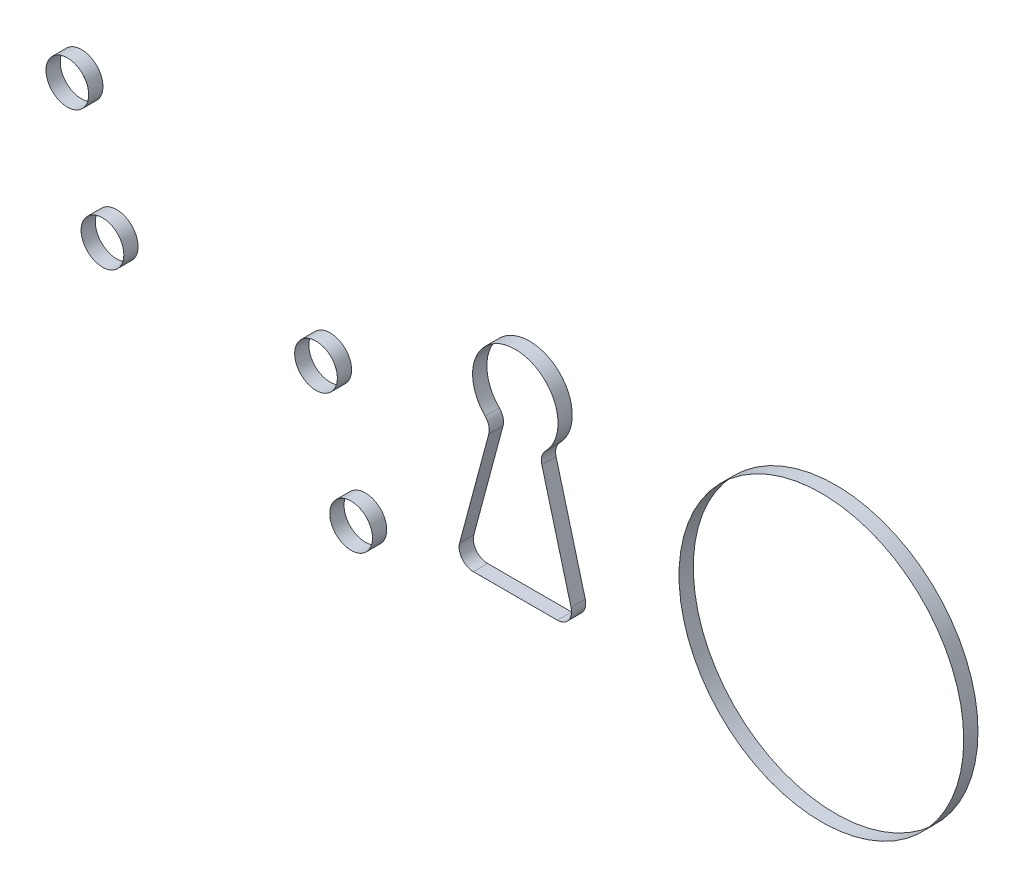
ISO-10303-21;
HEADER;
FILE_DESCRIPTION(('STEP AP214'),'2;1');
FILE_NAME('part.step','',(''),(''),'','','');
FILE_SCHEMA(('AUTOMOTIVE_DESIGN { 1 0 10303 214 1 1 1 1 }'));
ENDSEC;
DATA;
#1=APPLICATION_CONTEXT('core data for automotive mechanical design processes');
#2=APPLICATION_PROTOCOL_DEFINITION('international standard','automotive_design',2000,#1);
#3=PRODUCT_CONTEXT('',#1,'mechanical');
#4=PRODUCT('Part','Part','',(#3));
#5=PRODUCT_RELATED_PRODUCT_CATEGORY('part','',(#4));
#6=PRODUCT_DEFINITION_FORMATION('','',#4);
#7=PRODUCT_DEFINITION_CONTEXT('part definition',#1,'design');
#8=PRODUCT_DEFINITION('design','',#6,#7);
#9=PRODUCT_DEFINITION_SHAPE('','',#8);
#10=(LENGTH_UNIT() NAMED_UNIT(*) SI_UNIT(.MILLI.,.METRE.));
#11=(NAMED_UNIT(*) PLANE_ANGLE_UNIT() SI_UNIT($,.RADIAN.));
#12=(NAMED_UNIT(*) SI_UNIT($,.STERADIAN.) SOLID_ANGLE_UNIT());
#13=UNCERTAINTY_MEASURE_WITH_UNIT(LENGTH_MEASURE(1.E-05),#10,'distance_accuracy_value','');
#14=(GEOMETRIC_REPRESENTATION_CONTEXT(3) GLOBAL_UNCERTAINTY_ASSIGNED_CONTEXT((#13)) GLOBAL_UNIT_ASSIGNED_CONTEXT((#10,
#11,#12)) REPRESENTATION_CONTEXT('',''));
#15=CARTESIAN_POINT('',(0.,0.,0.));
#16=DIRECTION('',(0.,0.,1.));
#17=DIRECTION('',(1.,0.,0.));
#18=AXIS2_PLACEMENT_3D('',#15,#16,#17);
#19=CARTESIAN_POINT('',(43.,0.,1.));
#20=DIRECTION('',(0.,0.,1.));
#21=DIRECTION('',(1.,0.,0.));
#22=AXIS2_PLACEMENT_3D('',#19,#20,#21);
#23=PLANE('',#22);
#24=CARTESIAN_POINT('',(43.,0.,1.));
#25=DIRECTION('',(0.,0.,1.));
#26=DIRECTION('',(1.,0.,0.));
#27=AXIS2_PLACEMENT_3D('',#24,#25,#26);
#28=CIRCLE('',#27,10.001);
#29=CARTESIAN_POINT('',(53.001,0.,1.));
#30=VERTEX_POINT('',#29);
#31=EDGE_CURVE('E12',#30,#30,#28,.T.);
#32=ORIENTED_EDGE('',*,*,#31,.T.);
#33=EDGE_LOOP('',(#32));
#34=FACE_BOUND('',#33,.T.);
#35=CARTESIAN_POINT('',(43.,0.,1.));
#36=DIRECTION('',(0.,0.,1.));
#37=DIRECTION('',(1.,0.,0.));
#38=AXIS2_PLACEMENT_3D('',#35,#36,#37);
#39=CIRCLE('',#38,10.);
#40=CARTESIAN_POINT('',(53.,0.,1.));
#41=VERTEX_POINT('',#40);
#42=EDGE_CURVE('E131',#41,#41,#39,.T.);
#43=ORIENTED_EDGE('',*,*,#42,.F.);
#44=EDGE_LOOP('',(#43));
#45=FACE_BOUND('',#44,.T.);
#46=ADVANCED_FACE('F120',(#34,#45),#23,.T.);
#47=CARTESIAN_POINT('',(43.,0.,0.));
#48=DIRECTION('',(0.,0.,1.));
#49=DIRECTION('',(1.,0.,0.));
#50=AXIS2_PLACEMENT_3D('',#47,#48,#49);
#51=PLANE('',#50);
#52=CARTESIAN_POINT('',(43.,0.,0.));
#53=DIRECTION('',(0.,0.,1.));
#54=DIRECTION('',(1.,0.,0.));
#55=AXIS2_PLACEMENT_3D('',#52,#53,#54);
#56=CIRCLE('',#55,10.001);
#57=CARTESIAN_POINT('',(53.001,0.,0.));
#58=VERTEX_POINT('',#57);
#59=EDGE_CURVE('E124',#58,#58,#56,.T.);
#60=ORIENTED_EDGE('',*,*,#59,.F.);
#61=EDGE_LOOP('',(#60));
#62=FACE_BOUND('',#61,.T.);
#63=CARTESIAN_POINT('',(43.,0.,0.));
#64=DIRECTION('',(0.,0.,1.));
#65=DIRECTION('',(1.,0.,0.));
#66=AXIS2_PLACEMENT_3D('',#63,#64,#65);
#67=CIRCLE('',#66,10.);
#68=CARTESIAN_POINT('',(53.,0.,0.));
#69=VERTEX_POINT('',#68);
#70=EDGE_CURVE('E133',#69,#69,#67,.T.);
#71=ORIENTED_EDGE('',*,*,#70,.T.);
#72=EDGE_LOOP('',(#71));
#73=FACE_BOUND('',#72,.T.);
#74=ADVANCED_FACE('F143',(#62,#73),#51,.F.);
#75=CARTESIAN_POINT('',(43.,0.,1.));
#76=DIRECTION('',(0.,0.,-1.));
#77=DIRECTION('',(-1.,0.,0.));
#78=AXIS2_PLACEMENT_3D('',#75,#76,#77);
#79=CYLINDRICAL_SURFACE('',#78,10.001);
#80=ORIENTED_EDGE('',*,*,#31,.F.);
#81=EDGE_LOOP('',(#80));
#82=FACE_BOUND('',#81,.T.);
#83=ORIENTED_EDGE('',*,*,#59,.T.);
#84=EDGE_LOOP('',(#83));
#85=FACE_BOUND('',#84,.T.);
#86=ADVANCED_FACE('F122',(#82,#85),#79,.T.);
#87=CARTESIAN_POINT('',(43.,0.,1.));
#88=DIRECTION('',(0.,0.,-1.));
#89=DIRECTION('',(-1.,0.,0.));
#90=AXIS2_PLACEMENT_3D('',#87,#88,#89);
#91=CYLINDRICAL_SURFACE('',#90,10.);
#92=ORIENTED_EDGE('',*,*,#42,.T.);
#93=EDGE_LOOP('',(#92));
#94=FACE_BOUND('',#93,.T.);
#95=ORIENTED_EDGE('',*,*,#70,.F.);
#96=EDGE_LOOP('',(#95));
#97=FACE_BOUND('',#96,.T.);
#98=ADVANCED_FACE('F139',(#94,#97),#91,.F.);
#99=CLOSED_SHELL('',(#46,#74,#86,#98));
#100=MANIFOLD_SOLID_BREP('B2',#99);
#101=CARTESIAN_POINT('',(-9.96794863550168,8.49999999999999,1.));
#102=DIRECTION('',(0.,0.,1.));
#103=DIRECTION('',(1.,0.,0.));
#104=AXIS2_PLACEMENT_3D('',#101,#102,#103);
#105=PLANE('',#104);
#106=CARTESIAN_POINT('',(-9.96794863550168,8.49999999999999,1.));
#107=DIRECTION('',(0.,0.,1.));
#108=DIRECTION('',(1.,0.,0.));
#109=AXIS2_PLACEMENT_3D('',#106,#107,#108);
#110=CIRCLE('',#109,1.501);
#111=CARTESIAN_POINT('',(-8.46694863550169,8.49999999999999,1.));
#112=VERTEX_POINT('',#111);
#113=EDGE_CURVE('E119',#112,#112,#110,.T.);
#114=ORIENTED_EDGE('',*,*,#113,.T.);
#115=EDGE_LOOP('',(#114));
#116=FACE_BOUND('',#115,.T.);
#117=CARTESIAN_POINT('',(-9.96794863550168,8.49999999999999,1.));
#118=DIRECTION('',(0.,0.,1.));
#119=DIRECTION('',(1.,0.,0.));
#120=AXIS2_PLACEMENT_3D('',#117,#118,#119);
#121=CIRCLE('',#120,1.5);
#122=CARTESIAN_POINT('',(-8.46794863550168,8.49999999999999,1.));
#123=VERTEX_POINT('',#122);
#124=EDGE_CURVE('E201',#123,#123,#121,.T.);
#125=ORIENTED_EDGE('',*,*,#124,.F.);
#126=EDGE_LOOP('',(#125));
#127=FACE_BOUND('',#126,.T.);
#128=ADVANCED_FACE('F190',(#116,#127),#105,.T.);
#129=CARTESIAN_POINT('',(-9.96794863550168,8.49999999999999,0.));
#130=DIRECTION('',(0.,0.,1.));
#131=DIRECTION('',(1.,0.,0.));
#132=AXIS2_PLACEMENT_3D('',#129,#130,#131);
#133=PLANE('',#132);
#134=CARTESIAN_POINT('',(-9.96794863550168,8.49999999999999,0.));
#135=DIRECTION('',(0.,0.,1.));
#136=DIRECTION('',(1.,0.,0.));
#137=AXIS2_PLACEMENT_3D('',#134,#135,#136);
#138=CIRCLE('',#137,1.501);
#139=CARTESIAN_POINT('',(-8.46694863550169,8.49999999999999,0.));
#140=VERTEX_POINT('',#139);
#141=EDGE_CURVE('E194',#140,#140,#138,.T.);
#142=ORIENTED_EDGE('',*,*,#141,.F.);
#143=EDGE_LOOP('',(#142));
#144=FACE_BOUND('',#143,.T.);
#145=CARTESIAN_POINT('',(-9.96794863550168,8.49999999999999,0.));
#146=DIRECTION('',(0.,0.,1.));
#147=DIRECTION('',(1.,0.,0.));
#148=AXIS2_PLACEMENT_3D('',#145,#146,#147);
#149=CIRCLE('',#148,1.5);
#150=CARTESIAN_POINT('',(-8.46794863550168,8.49999999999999,0.));
#151=VERTEX_POINT('',#150);
#152=EDGE_CURVE('E203',#151,#151,#149,.T.);
#153=ORIENTED_EDGE('',*,*,#152,.T.);
#154=EDGE_LOOP('',(#153));
#155=FACE_BOUND('',#154,.T.);
#156=ADVANCED_FACE('F213',(#144,#155),#133,.F.);
#157=CARTESIAN_POINT('',(-9.96794863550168,8.49999999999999,1.));
#158=DIRECTION('',(0.,0.,-1.));
#159=DIRECTION('',(-1.,0.,0.));
#160=AXIS2_PLACEMENT_3D('',#157,#158,#159);
#161=CYLINDRICAL_SURFACE('',#160,1.501);
#162=ORIENTED_EDGE('',*,*,#113,.F.);
#163=EDGE_LOOP('',(#162));
#164=FACE_BOUND('',#163,.T.);
#165=ORIENTED_EDGE('',*,*,#141,.T.);
#166=EDGE_LOOP('',(#165));
#167=FACE_BOUND('',#166,.T.);
#168=ADVANCED_FACE('F192',(#164,#167),#161,.T.);
#169=CARTESIAN_POINT('',(-9.96794863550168,8.49999999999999,1.));
#170=DIRECTION('',(0.,0.,-1.));
#171=DIRECTION('',(-1.,0.,0.));
#172=AXIS2_PLACEMENT_3D('',#169,#170,#171);
#173=CYLINDRICAL_SURFACE('',#172,1.5);
#174=ORIENTED_EDGE('',*,*,#124,.T.);
#175=EDGE_LOOP('',(#174));
#176=FACE_BOUND('',#175,.T.);
#177=ORIENTED_EDGE('',*,*,#152,.F.);
#178=EDGE_LOOP('',(#177));
#179=FACE_BOUND('',#178,.T.);
#180=ADVANCED_FACE('F209',(#176,#179),#173,.F.);
#181=CLOSED_SHELL('',(#128,#156,#168,#180));
#182=MANIFOLD_SOLID_BREP('B7',#181);
#183=CARTESIAN_POINT('',(9.96794863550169,-8.5,1.));
#184=DIRECTION('',(0.,0.,1.));
#185=DIRECTION('',(1.,0.,0.));
#186=AXIS2_PLACEMENT_3D('',#183,#184,#185);
#187=PLANE('',#186);
#188=CARTESIAN_POINT('',(9.96794863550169,-8.5,1.));
#189=DIRECTION('',(0.,0.,1.));
#190=DIRECTION('',(1.,0.,0.));
#191=AXIS2_PLACEMENT_3D('',#188,#189,#190);
#192=CIRCLE('',#191,1.501);
#193=CARTESIAN_POINT('',(11.4689486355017,-8.5,1.));
#194=VERTEX_POINT('',#193);
#195=EDGE_CURVE('E189',#194,#194,#192,.T.);
#196=ORIENTED_EDGE('',*,*,#195,.T.);
#197=EDGE_LOOP('',(#196));
#198=FACE_BOUND('',#197,.T.);
#199=CARTESIAN_POINT('',(9.96794863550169,-8.5,1.));
#200=DIRECTION('',(0.,0.,1.));
#201=DIRECTION('',(1.,0.,0.));
#202=AXIS2_PLACEMENT_3D('',#199,#200,#201);
#203=CIRCLE('',#202,1.5);
#204=CARTESIAN_POINT('',(11.4679486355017,-8.5,1.));
#205=VERTEX_POINT('',#204);
#206=EDGE_CURVE('E271',#205,#205,#203,.T.);
#207=ORIENTED_EDGE('',*,*,#206,.F.);
#208=EDGE_LOOP('',(#207));
#209=FACE_BOUND('',#208,.T.);
#210=ADVANCED_FACE('F260',(#198,#209),#187,.T.);
#211=CARTESIAN_POINT('',(9.96794863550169,-8.5,0.));
#212=DIRECTION('',(0.,0.,1.));
#213=DIRECTION('',(1.,0.,0.));
#214=AXIS2_PLACEMENT_3D('',#211,#212,#213);
#215=PLANE('',#214);
#216=CARTESIAN_POINT('',(9.96794863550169,-8.5,0.));
#217=DIRECTION('',(0.,0.,1.));
#218=DIRECTION('',(1.,0.,0.));
#219=AXIS2_PLACEMENT_3D('',#216,#217,#218);
#220=CIRCLE('',#219,1.501);
#221=CARTESIAN_POINT('',(11.4689486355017,-8.5,0.));
#222=VERTEX_POINT('',#221);
#223=EDGE_CURVE('E264',#222,#222,#220,.T.);
#224=ORIENTED_EDGE('',*,*,#223,.F.);
#225=EDGE_LOOP('',(#224));
#226=FACE_BOUND('',#225,.T.);
#227=CARTESIAN_POINT('',(9.96794863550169,-8.5,0.));
#228=DIRECTION('',(0.,0.,1.));
#229=DIRECTION('',(1.,0.,0.));
#230=AXIS2_PLACEMENT_3D('',#227,#228,#229);
#231=CIRCLE('',#230,1.5);
#232=CARTESIAN_POINT('',(11.4679486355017,-8.5,0.));
#233=VERTEX_POINT('',#232);
#234=EDGE_CURVE('E273',#233,#233,#231,.T.);
#235=ORIENTED_EDGE('',*,*,#234,.T.);
#236=EDGE_LOOP('',(#235));
#237=FACE_BOUND('',#236,.T.);
#238=ADVANCED_FACE('F283',(#226,#237),#215,.F.);
#239=CARTESIAN_POINT('',(9.96794863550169,-8.5,1.));
#240=DIRECTION('',(0.,0.,-1.));
#241=DIRECTION('',(-1.,0.,0.));
#242=AXIS2_PLACEMENT_3D('',#239,#240,#241);
#243=CYLINDRICAL_SURFACE('',#242,1.501);
#244=ORIENTED_EDGE('',*,*,#195,.F.);
#245=EDGE_LOOP('',(#244));
#246=FACE_BOUND('',#245,.T.);
#247=ORIENTED_EDGE('',*,*,#223,.T.);
#248=EDGE_LOOP('',(#247));
#249=FACE_BOUND('',#248,.T.);
#250=ADVANCED_FACE('F262',(#246,#249),#243,.T.);
#251=CARTESIAN_POINT('',(9.96794863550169,-8.5,1.));
#252=DIRECTION('',(0.,0.,-1.));
#253=DIRECTION('',(-1.,0.,0.));
#254=AXIS2_PLACEMENT_3D('',#251,#252,#253);
#255=CYLINDRICAL_SURFACE('',#254,1.5);
#256=ORIENTED_EDGE('',*,*,#206,.T.);
#257=EDGE_LOOP('',(#256));
#258=FACE_BOUND('',#257,.T.);
#259=ORIENTED_EDGE('',*,*,#234,.F.);
#260=EDGE_LOOP('',(#259));
#261=FACE_BOUND('',#260,.T.);
#262=ADVANCED_FACE('F279',(#258,#261),#255,.F.);
#263=CLOSED_SHELL('',(#210,#238,#250,#262));
#264=MANIFOLD_SOLID_BREP('B114',#263);
#265=CARTESIAN_POINT('',(-7.5,0.,1.));
#266=DIRECTION('',(0.,0.,1.));
#267=DIRECTION('',(1.,0.,0.));
#268=AXIS2_PLACEMENT_3D('',#265,#266,#267);
#269=PLANE('',#268);
#270=CARTESIAN_POINT('',(-7.5,0.,1.));
#271=DIRECTION('',(0.,0.,1.));
#272=DIRECTION('',(1.,0.,0.));
#273=AXIS2_PLACEMENT_3D('',#270,#271,#272);
#274=CIRCLE('',#273,1.501);
#275=CARTESIAN_POINT('',(-5.999,0.,1.));
#276=VERTEX_POINT('',#275);
#277=EDGE_CURVE('E259',#276,#276,#274,.T.);
#278=ORIENTED_EDGE('',*,*,#277,.T.);
#279=EDGE_LOOP('',(#278));
#280=FACE_BOUND('',#279,.T.);
#281=CARTESIAN_POINT('',(-7.5,0.,1.));
#282=DIRECTION('',(0.,0.,1.));
#283=DIRECTION('',(1.,0.,0.));
#284=AXIS2_PLACEMENT_3D('',#281,#282,#283);
#285=CIRCLE('',#284,1.5);
#286=CARTESIAN_POINT('',(-6.,0.,1.));
#287=VERTEX_POINT('',#286);
#288=EDGE_CURVE('E341',#287,#287,#285,.T.);
#289=ORIENTED_EDGE('',*,*,#288,.F.);
#290=EDGE_LOOP('',(#289));
#291=FACE_BOUND('',#290,.T.);
#292=ADVANCED_FACE('F330',(#280,#291),#269,.T.);
#293=CARTESIAN_POINT('',(-7.5,0.,0.));
#294=DIRECTION('',(0.,0.,1.));
#295=DIRECTION('',(1.,0.,0.));
#296=AXIS2_PLACEMENT_3D('',#293,#294,#295);
#297=PLANE('',#296);
#298=CARTESIAN_POINT('',(-7.5,0.,0.));
#299=DIRECTION('',(0.,0.,1.));
#300=DIRECTION('',(1.,0.,0.));
#301=AXIS2_PLACEMENT_3D('',#298,#299,#300);
#302=CIRCLE('',#301,1.501);
#303=CARTESIAN_POINT('',(-5.999,0.,0.));
#304=VERTEX_POINT('',#303);
#305=EDGE_CURVE('E334',#304,#304,#302,.T.);
#306=ORIENTED_EDGE('',*,*,#305,.F.);
#307=EDGE_LOOP('',(#306));
#308=FACE_BOUND('',#307,.T.);
#309=CARTESIAN_POINT('',(-7.5,0.,0.));
#310=DIRECTION('',(0.,0.,1.));
#311=DIRECTION('',(1.,0.,0.));
#312=AXIS2_PLACEMENT_3D('',#309,#310,#311);
#313=CIRCLE('',#312,1.5);
#314=CARTESIAN_POINT('',(-6.,0.,0.));
#315=VERTEX_POINT('',#314);
#316=EDGE_CURVE('E343',#315,#315,#313,.T.);
#317=ORIENTED_EDGE('',*,*,#316,.T.);
#318=EDGE_LOOP('',(#317));
#319=FACE_BOUND('',#318,.T.);
#320=ADVANCED_FACE('F353',(#308,#319),#297,.F.);
#321=CARTESIAN_POINT('',(-7.5,0.,1.));
#322=DIRECTION('',(0.,0.,-1.));
#323=DIRECTION('',(-1.,0.,0.));
#324=AXIS2_PLACEMENT_3D('',#321,#322,#323);
#325=CYLINDRICAL_SURFACE('',#324,1.501);
#326=ORIENTED_EDGE('',*,*,#277,.F.);
#327=EDGE_LOOP('',(#326));
#328=FACE_BOUND('',#327,.T.);
#329=ORIENTED_EDGE('',*,*,#305,.T.);
#330=EDGE_LOOP('',(#329));
#331=FACE_BOUND('',#330,.T.);
#332=ADVANCED_FACE('F332',(#328,#331),#325,.T.);
#333=CARTESIAN_POINT('',(-7.5,0.,1.));
#334=DIRECTION('',(0.,0.,-1.));
#335=DIRECTION('',(-1.,0.,0.));
#336=AXIS2_PLACEMENT_3D('',#333,#334,#335);
#337=CYLINDRICAL_SURFACE('',#336,1.5);
#338=ORIENTED_EDGE('',*,*,#288,.T.);
#339=EDGE_LOOP('',(#338));
#340=FACE_BOUND('',#339,.T.);
#341=ORIENTED_EDGE('',*,*,#316,.F.);
#342=EDGE_LOOP('',(#341));
#343=FACE_BOUND('',#342,.T.);
#344=ADVANCED_FACE('F349',(#340,#343),#337,.F.);
#345=CLOSED_SHELL('',(#292,#320,#332,#344));
#346=MANIFOLD_SOLID_BREP('B184',#345);
#347=CARTESIAN_POINT('',(7.5,0.,1.));
#348=DIRECTION('',(0.,0.,1.));
#349=DIRECTION('',(1.,0.,0.));
#350=AXIS2_PLACEMENT_3D('',#347,#348,#349);
#351=PLANE('',#350);
#352=CARTESIAN_POINT('',(7.5,0.,1.));
#353=DIRECTION('',(0.,0.,1.));
#354=DIRECTION('',(1.,0.,0.));
#355=AXIS2_PLACEMENT_3D('',#352,#353,#354);
#356=CIRCLE('',#355,1.501);
#357=CARTESIAN_POINT('',(9.001,0.,1.));
#358=VERTEX_POINT('',#357);
#359=EDGE_CURVE('E329',#358,#358,#356,.T.);
#360=ORIENTED_EDGE('',*,*,#359,.T.);
#361=EDGE_LOOP('',(#360));
#362=FACE_BOUND('',#361,.T.);
#363=CARTESIAN_POINT('',(7.5,0.,1.));
#364=DIRECTION('',(0.,0.,1.));
#365=DIRECTION('',(1.,0.,0.));
#366=AXIS2_PLACEMENT_3D('',#363,#364,#365);
#367=CIRCLE('',#366,1.5);
#368=CARTESIAN_POINT('',(9.00000000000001,0.,1.));
#369=VERTEX_POINT('',#368);
#370=EDGE_CURVE('E412',#369,#369,#367,.T.);
#371=ORIENTED_EDGE('',*,*,#370,.F.);
#372=EDGE_LOOP('',(#371));
#373=FACE_BOUND('',#372,.T.);
#374=ADVANCED_FACE('F401',(#362,#373),#351,.T.);
#375=CARTESIAN_POINT('',(7.5,0.,0.));
#376=DIRECTION('',(0.,0.,1.));
#377=DIRECTION('',(1.,0.,0.));
#378=AXIS2_PLACEMENT_3D('',#375,#376,#377);
#379=PLANE('',#378);
#380=CARTESIAN_POINT('',(7.5,0.,0.));
#381=DIRECTION('',(0.,0.,1.));
#382=DIRECTION('',(1.,0.,0.));
#383=AXIS2_PLACEMENT_3D('',#380,#381,#382);
#384=CIRCLE('',#383,1.501);
#385=CARTESIAN_POINT('',(9.001,0.,0.));
#386=VERTEX_POINT('',#385);
#387=EDGE_CURVE('E405',#386,#386,#384,.T.);
#388=ORIENTED_EDGE('',*,*,#387,.F.);
#389=EDGE_LOOP('',(#388));
#390=FACE_BOUND('',#389,.T.);
#391=CARTESIAN_POINT('',(7.5,0.,0.));
#392=DIRECTION('',(0.,0.,1.));
#393=DIRECTION('',(1.,0.,0.));
#394=AXIS2_PLACEMENT_3D('',#391,#392,#393);
#395=CIRCLE('',#394,1.5);
#396=CARTESIAN_POINT('',(9.00000000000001,0.,0.));
#397=VERTEX_POINT('',#396);
#398=EDGE_CURVE('E414',#397,#397,#395,.T.);
#399=ORIENTED_EDGE('',*,*,#398,.T.);
#400=EDGE_LOOP('',(#399));
#401=FACE_BOUND('',#400,.T.);
#402=ADVANCED_FACE('F424',(#390,#401),#379,.F.);
#403=CARTESIAN_POINT('',(7.5,0.,1.));
#404=DIRECTION('',(0.,0.,-1.));
#405=DIRECTION('',(-1.,0.,0.));
#406=AXIS2_PLACEMENT_3D('',#403,#404,#405);
#407=CYLINDRICAL_SURFACE('',#406,1.501);
#408=ORIENTED_EDGE('',*,*,#359,.F.);
#409=EDGE_LOOP('',(#408));
#410=FACE_BOUND('',#409,.T.);
#411=ORIENTED_EDGE('',*,*,#387,.T.);
#412=EDGE_LOOP('',(#411));
#413=FACE_BOUND('',#412,.T.);
#414=ADVANCED_FACE('F403',(#410,#413),#407,.T.);
#415=CARTESIAN_POINT('',(7.5,0.,1.));
#416=DIRECTION('',(0.,0.,-1.));
#417=DIRECTION('',(-1.,0.,0.));
#418=AXIS2_PLACEMENT_3D('',#415,#416,#417);
#419=CYLINDRICAL_SURFACE('',#418,1.5);
#420=ORIENTED_EDGE('',*,*,#370,.T.);
#421=EDGE_LOOP('',(#420));
#422=FACE_BOUND('',#421,.T.);
#423=ORIENTED_EDGE('',*,*,#398,.F.);
#424=EDGE_LOOP('',(#423));
#425=FACE_BOUND('',#424,.T.);
#426=ADVANCED_FACE('F420',(#422,#425),#419,.F.);
#427=CLOSED_SHELL('',(#374,#402,#414,#426));
#428=MANIFOLD_SOLID_BREP('B254',#427);
#429=CARTESIAN_POINT('',(24.4474411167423,-6.,1.));
#430=DIRECTION('',(0.,0.,1.));
#431=DIRECTION('',(1.,0.,0.));
#432=AXIS2_PLACEMENT_3D('',#429,#430,#431);
#433=PLANE('',#432);
#434=CARTESIAN_POINT('',(24.4474411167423,-6.,1.));
#435=DIRECTION('',(0.,0.,1.));
#436=DIRECTION('',(1.,0.,0.));
#437=AXIS2_PLACEMENT_3D('',#434,#435,#436);
#438=CIRCLE('',#437,1.001);
#439=CARTESIAN_POINT('',(24.4474411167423,-7.001,1.));
#440=VERTEX_POINT('',#439);
#441=CARTESIAN_POINT('',(25.4143328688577,-5.74092213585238,1.));
#442=VERTEX_POINT('',#441);
#443=EDGE_CURVE('E641',#440,#442,#438,.T.);
#444=ORIENTED_EDGE('',*,*,#443,.T.);
#445=DIRECTION('',(-0.258819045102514,0.96592582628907,0.));
#446=VECTOR('',#445,1.);
#447=CARTESIAN_POINT('',(25.4143328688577,-5.74092213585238,1.));
#448=LINE('',#447,#446);
#449=CARTESIAN_POINT('',(23.3634672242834,1.9130126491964,1.));
#450=VERTEX_POINT('',#449);
#451=EDGE_CURVE('E644',#442,#450,#448,.T.);
#452=ORIENTED_EDGE('',*,*,#451,.T.);
#453=CARTESIAN_POINT('',(24.3284271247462,2.17157287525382,1.));
#454=DIRECTION('',(0.,0.,1.));
#455=DIRECTION('',(1.,0.,0.));
#456=AXIS2_PLACEMENT_3D('',#453,#454,#455);
#457=CIRCLE('',#456,0.999000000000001);
#458=CARTESIAN_POINT('',(23.6220274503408,2.87797254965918,1.));
#459=VERTEX_POINT('',#458);
#460=EDGE_CURVE('E647',#450,#459,#457,.F.);
#461=ORIENTED_EDGE('',*,*,#460,.T.);
#462=CARTESIAN_POINT('',(21.5,5.,1.));
#463=DIRECTION('',(0.,0.,1.));
#464=DIRECTION('',(1.,0.,0.));
#465=AXIS2_PLACEMENT_3D('',#462,#463,#464);
#466=CIRCLE('',#465,3.001);
#467=CARTESIAN_POINT('',(19.3779725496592,2.87797254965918,1.));
#468=VERTEX_POINT('',#467);
#469=EDGE_CURVE('E649',#459,#468,#466,.T.);
#470=ORIENTED_EDGE('',*,*,#469,.T.);
#471=CARTESIAN_POINT('',(18.6715728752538,2.17157287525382,1.));
#472=DIRECTION('',(0.,0.,1.));
#473=DIRECTION('',(1.,0.,0.));
#474=AXIS2_PLACEMENT_3D('',#471,#472,#473);
#475=CIRCLE('',#474,0.999);
#476=CARTESIAN_POINT('',(19.6365327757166,1.91301264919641,1.));
#477=VERTEX_POINT('',#476);
#478=EDGE_CURVE('E651',#468,#477,#475,.F.);
#479=ORIENTED_EDGE('',*,*,#478,.T.);
#480=DIRECTION('',(-0.258819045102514,-0.96592582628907,0.));
#481=VECTOR('',#480,1.);
#482=CARTESIAN_POINT('',(19.6365327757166,1.91301264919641,1.));
#483=LINE('',#482,#481);
#484=CARTESIAN_POINT('',(17.5856671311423,-5.74092213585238,1.));
#485=VERTEX_POINT('',#484);
#486=EDGE_CURVE('E653',#477,#485,#483,.T.);
#487=ORIENTED_EDGE('',*,*,#486,.T.);
#488=CARTESIAN_POINT('',(18.5525588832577,-6.,1.));
#489=DIRECTION('',(0.,0.,1.));
#490=DIRECTION('',(1.,0.,0.));
#491=AXIS2_PLACEMENT_3D('',#488,#489,#490);
#492=CIRCLE('',#491,1.001);
#493=CARTESIAN_POINT('',(18.5525588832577,-7.001,1.));
#494=VERTEX_POINT('',#493);
#495=EDGE_CURVE('E655',#485,#494,#492,.T.);
#496=ORIENTED_EDGE('',*,*,#495,.T.);
#497=DIRECTION('',(1.,0.,0.));
#498=VECTOR('',#497,1.);
#499=CARTESIAN_POINT('',(18.5525588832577,-7.001,1.));
#500=LINE('',#499,#498);
#501=EDGE_CURVE('E657',#494,#440,#500,.T.);
#502=ORIENTED_EDGE('',*,*,#501,.T.);
#503=EDGE_LOOP('',(#444,#452,#461,#470,#479,#487,#496,#502));
#504=FACE_BOUND('',#503,.T.);
#505=DIRECTION('',(-0.258819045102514,0.96592582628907,0.));
#506=VECTOR('',#505,1.);
#507=CARTESIAN_POINT('',(25.4133669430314,-5.74118095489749,1.));
#508=LINE('',#507,#506);
#509=CARTESIAN_POINT('',(25.4133669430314,-5.74118095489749,1.));
#510=VERTEX_POINT('',#509);
#511=CARTESIAN_POINT('',(23.3625012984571,1.9127538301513,1.));
#512=VERTEX_POINT('',#511);
#513=EDGE_CURVE('E584',#510,#512,#508,.T.);
#514=ORIENTED_EDGE('',*,*,#513,.F.);
#515=CARTESIAN_POINT('',(24.4474411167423,-6.,1.));
#516=DIRECTION('',(0.,0.,1.));
#517=DIRECTION('',(1.,0.,0.));
#518=AXIS2_PLACEMENT_3D('',#515,#516,#517);
#519=CIRCLE('',#518,1.);
#520=CARTESIAN_POINT('',(24.4474411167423,-7.,1.));
#521=VERTEX_POINT('',#520);
#522=EDGE_CURVE('E576',#521,#510,#519,.T.);
#523=ORIENTED_EDGE('',*,*,#522,.F.);
#524=DIRECTION('',(1.,0.,0.));
#525=VECTOR('',#524,1.);
#526=CARTESIAN_POINT('',(18.5525588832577,-7.,1.));
#527=LINE('',#526,#525);
#528=CARTESIAN_POINT('',(18.5525588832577,-7.,1.));
#529=VERTEX_POINT('',#528);
#530=EDGE_CURVE('E609',#529,#521,#527,.T.);
#531=ORIENTED_EDGE('',*,*,#530,.F.);
#532=CARTESIAN_POINT('',(18.5525588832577,-6.,1.));
#533=DIRECTION('',(0.,0.,1.));
#534=DIRECTION('',(1.,0.,0.));
#535=AXIS2_PLACEMENT_3D('',#532,#533,#534);
#536=CIRCLE('',#535,1.);
#537=CARTESIAN_POINT('',(17.5866330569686,-5.74118095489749,1.));
#538=VERTEX_POINT('',#537);
#539=EDGE_CURVE('E607',#538,#529,#536,.T.);
#540=ORIENTED_EDGE('',*,*,#539,.F.);
#541=DIRECTION('',(-0.258819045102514,-0.96592582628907,0.));
#542=VECTOR('',#541,1.);
#543=CARTESIAN_POINT('',(19.6374987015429,1.9127538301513,1.));
#544=LINE('',#543,#542);
#545=CARTESIAN_POINT('',(19.6374987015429,1.9127538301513,1.));
#546=VERTEX_POINT('',#545);
#547=EDGE_CURVE('E605',#546,#538,#544,.T.);
#548=ORIENTED_EDGE('',*,*,#547,.F.);
#549=CARTESIAN_POINT('',(18.6715728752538,2.17157287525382,1.));
#550=DIRECTION('',(0.,0.,-1.));
#551=DIRECTION('',(1.,0.,0.));
#552=AXIS2_PLACEMENT_3D('',#549,#550,#551);
#553=CIRCLE('',#552,1.);
#554=CARTESIAN_POINT('',(19.3786796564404,2.87867965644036,1.));
#555=VERTEX_POINT('',#554);
#556=EDGE_CURVE('E603',#555,#546,#553,.T.);
#557=ORIENTED_EDGE('',*,*,#556,.F.);
#558=CARTESIAN_POINT('',(21.5,5.,1.));
#559=DIRECTION('',(0.,0.,1.));
#560=DIRECTION('',(1.,0.,0.));
#561=AXIS2_PLACEMENT_3D('',#558,#559,#560);
#562=CIRCLE('',#561,3.);
#563=CARTESIAN_POINT('',(23.6213203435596,2.87867965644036,1.));
#564=VERTEX_POINT('',#563);
#565=EDGE_CURVE('E599',#564,#555,#562,.T.);
#566=ORIENTED_EDGE('',*,*,#565,.F.);
#567=CARTESIAN_POINT('',(24.3284271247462,2.17157287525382,1.));
#568=DIRECTION('',(0.,0.,-1.));
#569=DIRECTION('',(1.,0.,0.));
#570=AXIS2_PLACEMENT_3D('',#567,#568,#569);
#571=CIRCLE('',#570,1.);
#572=EDGE_CURVE('E597',#512,#564,#571,.T.);
#573=ORIENTED_EDGE('',*,*,#572,.F.);
#574=EDGE_LOOP('',(#514,#523,#531,#540,#548,#557,#566,#573));
#575=FACE_BOUND('',#574,.T.);
#576=ADVANCED_FACE('F463',(#504,#575),#433,.T.);
#577=CARTESIAN_POINT('',(24.4474411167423,-6.,0.));
#578=DIRECTION('',(0.,0.,1.));
#579=DIRECTION('',(1.,0.,0.));
#580=AXIS2_PLACEMENT_3D('',#577,#578,#579);
#581=PLANE('',#580);
#582=CARTESIAN_POINT('',(24.4474411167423,-6.,0.));
#583=DIRECTION('',(0.,0.,1.));
#584=DIRECTION('',(1.,0.,0.));
#585=AXIS2_PLACEMENT_3D('',#582,#583,#584);
#586=CIRCLE('',#585,1.001);
#587=CARTESIAN_POINT('',(24.4474411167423,-7.001,0.));
#588=VERTEX_POINT('',#587);
#589=CARTESIAN_POINT('',(25.4143328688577,-5.74092213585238,0.));
#590=VERTEX_POINT('',#589);
#591=EDGE_CURVE('E592',#588,#590,#586,.T.);
#592=ORIENTED_EDGE('',*,*,#591,.F.);
#593=DIRECTION('',(1.,0.,0.));
#594=VECTOR('',#593,1.);
#595=CARTESIAN_POINT('',(18.5525588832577,-7.001,0.));
#596=LINE('',#595,#594);
#597=CARTESIAN_POINT('',(18.5525588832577,-7.001,0.));
#598=VERTEX_POINT('',#597);
#599=EDGE_CURVE('E645',#598,#588,#596,.T.);
#600=ORIENTED_EDGE('',*,*,#599,.F.);
#601=CARTESIAN_POINT('',(18.5525588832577,-6.,0.));
#602=DIRECTION('',(0.,0.,1.));
#603=DIRECTION('',(1.,0.,0.));
#604=AXIS2_PLACEMENT_3D('',#601,#602,#603);
#605=CIRCLE('',#604,1.001);
#606=CARTESIAN_POINT('',(17.5856671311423,-5.74092213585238,0.));
#607=VERTEX_POINT('',#606);
#608=EDGE_CURVE('E672',#607,#598,#605,.T.);
#609=ORIENTED_EDGE('',*,*,#608,.F.);
#610=DIRECTION('',(-0.258819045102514,-0.96592582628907,0.));
#611=VECTOR('',#610,1.);
#612=CARTESIAN_POINT('',(19.6365327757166,1.91301264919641,0.));
#613=LINE('',#612,#611);
#614=CARTESIAN_POINT('',(19.6365327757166,1.91301264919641,0.));
#615=VERTEX_POINT('',#614);
#616=EDGE_CURVE('E670',#615,#607,#613,.T.);
#617=ORIENTED_EDGE('',*,*,#616,.F.);
#618=CARTESIAN_POINT('',(18.6715728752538,2.17157287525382,0.));
#619=DIRECTION('',(0.,0.,1.));
#620=DIRECTION('',(1.,0.,0.));
#621=AXIS2_PLACEMENT_3D('',#618,#619,#620);
#622=CIRCLE('',#621,0.999);
#623=CARTESIAN_POINT('',(19.3779725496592,2.87797254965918,0.));
#624=VERTEX_POINT('',#623);
#625=EDGE_CURVE('E668',#624,#615,#622,.F.);
#626=ORIENTED_EDGE('',*,*,#625,.F.);
#627=CARTESIAN_POINT('',(21.5,5.,0.));
#628=DIRECTION('',(0.,0.,1.));
#629=DIRECTION('',(1.,0.,0.));
#630=AXIS2_PLACEMENT_3D('',#627,#628,#629);
#631=CIRCLE('',#630,3.001);
#632=CARTESIAN_POINT('',(23.6220274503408,2.87797254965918,0.));
#633=VERTEX_POINT('',#632);
#634=EDGE_CURVE('E666',#633,#624,#631,.T.);
#635=ORIENTED_EDGE('',*,*,#634,.F.);
#636=CARTESIAN_POINT('',(24.3284271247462,2.17157287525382,0.));
#637=DIRECTION('',(0.,0.,1.));
#638=DIRECTION('',(1.,0.,0.));
#639=AXIS2_PLACEMENT_3D('',#636,#637,#638);
#640=CIRCLE('',#639,0.999000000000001);
#641=CARTESIAN_POINT('',(23.3634672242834,1.9130126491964,0.));
#642=VERTEX_POINT('',#641);
#643=EDGE_CURVE('E664',#642,#633,#640,.F.);
#644=ORIENTED_EDGE('',*,*,#643,.F.);
#645=DIRECTION('',(-0.258819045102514,0.96592582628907,0.));
#646=VECTOR('',#645,1.);
#647=CARTESIAN_POINT('',(25.4143328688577,-5.74092213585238,0.));
#648=LINE('',#647,#646);
#649=EDGE_CURVE('E662',#590,#642,#648,.T.);
#650=ORIENTED_EDGE('',*,*,#649,.F.);
#651=EDGE_LOOP('',(#592,#600,#609,#617,#626,#635,#644,#650));
#652=FACE_BOUND('',#651,.T.);
#653=CARTESIAN_POINT('',(24.4474411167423,-6.,0.));
#654=DIRECTION('',(0.,0.,1.));
#655=DIRECTION('',(1.,0.,0.));
#656=AXIS2_PLACEMENT_3D('',#653,#654,#655);
#657=CIRCLE('',#656,1.);
#658=CARTESIAN_POINT('',(24.4474411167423,-7.,0.));
#659=VERTEX_POINT('',#658);
#660=CARTESIAN_POINT('',(25.4133669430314,-5.74118095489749,0.));
#661=VERTEX_POINT('',#660);
#662=EDGE_CURVE('E486',#659,#661,#657,.T.);
#663=ORIENTED_EDGE('',*,*,#662,.T.);
#664=DIRECTION('',(-0.258819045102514,0.96592582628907,0.));
#665=VECTOR('',#664,1.);
#666=CARTESIAN_POINT('',(25.4133669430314,-5.74118095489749,0.));
#667=LINE('',#666,#665);
#668=CARTESIAN_POINT('',(23.3625012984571,1.9127538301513,0.));
#669=VERTEX_POINT('',#668);
#670=EDGE_CURVE('E591',#661,#669,#667,.T.);
#671=ORIENTED_EDGE('',*,*,#670,.T.);
#672=CARTESIAN_POINT('',(24.3284271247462,2.17157287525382,0.));
#673=DIRECTION('',(0.,0.,-1.));
#674=DIRECTION('',(1.,0.,0.));
#675=AXIS2_PLACEMENT_3D('',#672,#673,#674);
#676=CIRCLE('',#675,1.);
#677=CARTESIAN_POINT('',(23.6213203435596,2.87867965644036,0.));
#678=VERTEX_POINT('',#677);
#679=EDGE_CURVE('E613',#669,#678,#676,.T.);
#680=ORIENTED_EDGE('',*,*,#679,.T.);
#681=CARTESIAN_POINT('',(21.5,5.,0.));
#682=DIRECTION('',(0.,0.,1.));
#683=DIRECTION('',(1.,0.,0.));
#684=AXIS2_PLACEMENT_3D('',#681,#682,#683);
#685=CIRCLE('',#684,3.);
#686=CARTESIAN_POINT('',(19.3786796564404,2.87867965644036,0.));
#687=VERTEX_POINT('',#686);
#688=EDGE_CURVE('E616',#678,#687,#685,.T.);
#689=ORIENTED_EDGE('',*,*,#688,.T.);
#690=CARTESIAN_POINT('',(18.6715728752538,2.17157287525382,0.));
#691=DIRECTION('',(0.,0.,-1.));
#692=DIRECTION('',(1.,0.,0.));
#693=AXIS2_PLACEMENT_3D('',#690,#691,#692);
#694=CIRCLE('',#693,1.);
#695=CARTESIAN_POINT('',(19.6374987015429,1.9127538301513,0.));
#696=VERTEX_POINT('',#695);
#697=EDGE_CURVE('E619',#687,#696,#694,.T.);
#698=ORIENTED_EDGE('',*,*,#697,.T.);
#699=DIRECTION('',(-0.258819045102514,-0.96592582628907,0.));
#700=VECTOR('',#699,1.);
#701=CARTESIAN_POINT('',(19.6374987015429,1.9127538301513,0.));
#702=LINE('',#701,#700);
#703=CARTESIAN_POINT('',(17.5866330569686,-5.74118095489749,0.));
#704=VERTEX_POINT('',#703);
#705=EDGE_CURVE('E622',#696,#704,#702,.T.);
#706=ORIENTED_EDGE('',*,*,#705,.T.);
#707=CARTESIAN_POINT('',(18.5525588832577,-6.,0.));
#708=DIRECTION('',(0.,0.,1.));
#709=DIRECTION('',(1.,0.,0.));
#710=AXIS2_PLACEMENT_3D('',#707,#708,#709);
#711=CIRCLE('',#710,1.);
#712=CARTESIAN_POINT('',(18.5525588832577,-7.,0.));
#713=VERTEX_POINT('',#712);
#714=EDGE_CURVE('E625',#704,#713,#711,.T.);
#715=ORIENTED_EDGE('',*,*,#714,.T.);
#716=DIRECTION('',(1.,0.,0.));
#717=VECTOR('',#716,1.);
#718=CARTESIAN_POINT('',(18.5525588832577,-7.,0.));
#719=LINE('',#718,#717);
#720=EDGE_CURVE('E585',#713,#659,#719,.T.);
#721=ORIENTED_EDGE('',*,*,#720,.T.);
#722=EDGE_LOOP('',(#663,#671,#680,#689,#698,#706,#715,#721));
#723=FACE_BOUND('',#722,.T.);
#724=ADVANCED_FACE('F702',(#652,#723),#581,.F.);
#725=CARTESIAN_POINT('',(24.4474411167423,-6.,1.));
#726=DIRECTION('',(0.,0.,-1.));
#727=DIRECTION('',(-1.,0.,0.));
#728=AXIS2_PLACEMENT_3D('',#725,#726,#727);
#729=CYLINDRICAL_SURFACE('',#728,1.001);
#730=ORIENTED_EDGE('',*,*,#591,.T.);
#731=DIRECTION('',(0.,0.,-1.));
#732=VECTOR('',#731,1.);
#733=CARTESIAN_POINT('',(25.4143328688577,-5.74092213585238,1.));
#734=LINE('',#733,#732);
#735=EDGE_CURVE('E399',#442,#590,#734,.T.);
#736=ORIENTED_EDGE('',*,*,#735,.F.);
#737=ORIENTED_EDGE('',*,*,#443,.F.);
#738=DIRECTION('',(0.,0.,-1.));
#739=VECTOR('',#738,1.);
#740=CARTESIAN_POINT('',(24.4474411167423,-7.001,1.));
#741=LINE('',#740,#739);
#742=EDGE_CURVE('E659',#440,#588,#741,.T.);
#743=ORIENTED_EDGE('',*,*,#742,.T.);
#744=EDGE_LOOP('',(#730,#736,#737,#743));
#745=FACE_BOUND('',#744,.T.);
#746=ADVANCED_FACE('F465',(#745),#729,.T.);
#747=CARTESIAN_POINT('',(25.4143328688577,-5.74092213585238,1.));
#748=DIRECTION('',(-0.96592582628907,-0.258819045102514,0.));
#749=DIRECTION('',(0.258819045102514,-0.96592582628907,0.));
#750=AXIS2_PLACEMENT_3D('',#747,#748,#749);
#751=PLANE('',#750);
#752=ORIENTED_EDGE('',*,*,#649,.T.);
#753=DIRECTION('',(0.,0.,-1.));
#754=VECTOR('',#753,1.);
#755=CARTESIAN_POINT('',(23.3634672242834,1.9130126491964,1.));
#756=LINE('',#755,#754);
#757=EDGE_CURVE('E471',#450,#642,#756,.T.);
#758=ORIENTED_EDGE('',*,*,#757,.F.);
#759=ORIENTED_EDGE('',*,*,#451,.F.);
#760=ORIENTED_EDGE('',*,*,#735,.T.);
#761=EDGE_LOOP('',(#752,#758,#759,#760));
#762=FACE_BOUND('',#761,.T.);
#763=ADVANCED_FACE('F719',(#762),#751,.F.);
#764=CARTESIAN_POINT('',(24.3284271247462,2.17157287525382,1.));
#765=DIRECTION('',(0.,0.,-1.));
#766=DIRECTION('',(-1.,0.,0.));
#767=AXIS2_PLACEMENT_3D('',#764,#765,#766);
#768=CYLINDRICAL_SURFACE('',#767,0.999000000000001);
#769=ORIENTED_EDGE('',*,*,#643,.T.);
#770=DIRECTION('',(0.,0.,-1.));
#771=VECTOR('',#770,1.);
#772=CARTESIAN_POINT('',(23.6220274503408,2.87797254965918,1.));
#773=LINE('',#772,#771);
#774=EDGE_CURVE('E689',#459,#633,#773,.T.);
#775=ORIENTED_EDGE('',*,*,#774,.F.);
#776=ORIENTED_EDGE('',*,*,#460,.F.);
#777=ORIENTED_EDGE('',*,*,#757,.T.);
#778=EDGE_LOOP('',(#769,#775,#776,#777));
#779=FACE_BOUND('',#778,.T.);
#780=ADVANCED_FACE('F696',(#779),#768,.F.);
#781=CARTESIAN_POINT('',(21.5,5.,1.));
#782=DIRECTION('',(0.,0.,-1.));
#783=DIRECTION('',(-1.,0.,0.));
#784=AXIS2_PLACEMENT_3D('',#781,#782,#783);
#785=CYLINDRICAL_SURFACE('',#784,3.001);
#786=ORIENTED_EDGE('',*,*,#634,.T.);
#787=DIRECTION('',(0.,0.,-1.));
#788=VECTOR('',#787,1.);
#789=CARTESIAN_POINT('',(19.3779725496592,2.87797254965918,1.));
#790=LINE('',#789,#788);
#791=EDGE_CURVE('E686',#468,#624,#790,.T.);
#792=ORIENTED_EDGE('',*,*,#791,.F.);
#793=ORIENTED_EDGE('',*,*,#469,.F.);
#794=ORIENTED_EDGE('',*,*,#774,.T.);
#795=EDGE_LOOP('',(#786,#792,#793,#794));
#796=FACE_BOUND('',#795,.T.);
#797=ADVANCED_FACE('F708',(#796),#785,.T.);
#798=CARTESIAN_POINT('',(18.6715728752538,2.17157287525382,1.));
#799=DIRECTION('',(0.,0.,-1.));
#800=DIRECTION('',(-1.,0.,0.));
#801=AXIS2_PLACEMENT_3D('',#798,#799,#800);
#802=CYLINDRICAL_SURFACE('',#801,0.999);
#803=ORIENTED_EDGE('',*,*,#625,.T.);
#804=DIRECTION('',(0.,0.,-1.));
#805=VECTOR('',#804,1.);
#806=CARTESIAN_POINT('',(19.6365327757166,1.91301264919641,1.));
#807=LINE('',#806,#805);
#808=EDGE_CURVE('E683',#477,#615,#807,.T.);
#809=ORIENTED_EDGE('',*,*,#808,.F.);
#810=ORIENTED_EDGE('',*,*,#478,.F.);
#811=ORIENTED_EDGE('',*,*,#791,.T.);
#812=EDGE_LOOP('',(#803,#809,#810,#811));
#813=FACE_BOUND('',#812,.T.);
#814=ADVANCED_FACE('F712',(#813),#802,.F.);
#815=CARTESIAN_POINT('',(19.6365327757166,1.91301264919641,1.));
#816=DIRECTION('',(0.96592582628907,-0.258819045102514,0.));
#817=DIRECTION('',(0.258819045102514,0.96592582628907,0.));
#818=AXIS2_PLACEMENT_3D('',#815,#816,#817);
#819=PLANE('',#818);
#820=ORIENTED_EDGE('',*,*,#616,.T.);
#821=DIRECTION('',(0.,0.,-1.));
#822=VECTOR('',#821,1.);
#823=CARTESIAN_POINT('',(17.5856671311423,-5.74092213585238,1.));
#824=LINE('',#823,#822);
#825=EDGE_CURVE('E680',#485,#607,#824,.T.);
#826=ORIENTED_EDGE('',*,*,#825,.F.);
#827=ORIENTED_EDGE('',*,*,#486,.F.);
#828=ORIENTED_EDGE('',*,*,#808,.T.);
#829=EDGE_LOOP('',(#820,#826,#827,#828));
#830=FACE_BOUND('',#829,.T.);
#831=ADVANCED_FACE('F732',(#830),#819,.F.);
#832=CARTESIAN_POINT('',(18.5525588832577,-6.,1.));
#833=DIRECTION('',(0.,0.,-1.));
#834=DIRECTION('',(-1.,0.,0.));
#835=AXIS2_PLACEMENT_3D('',#832,#833,#834);
#836=CYLINDRICAL_SURFACE('',#835,1.001);
#837=ORIENTED_EDGE('',*,*,#608,.T.);
#838=DIRECTION('',(0.,0.,-1.));
#839=VECTOR('',#838,1.);
#840=CARTESIAN_POINT('',(18.5525588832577,-7.001,1.));
#841=LINE('',#840,#839);
#842=EDGE_CURVE('E677',#494,#598,#841,.T.);
#843=ORIENTED_EDGE('',*,*,#842,.F.);
#844=ORIENTED_EDGE('',*,*,#495,.F.);
#845=ORIENTED_EDGE('',*,*,#825,.T.);
#846=EDGE_LOOP('',(#837,#843,#844,#845));
#847=FACE_BOUND('',#846,.T.);
#848=ADVANCED_FACE('F730',(#847),#836,.T.);
#849=CARTESIAN_POINT('',(18.5525588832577,-7.001,1.));
#850=DIRECTION('',(0.,1.,0.));
#851=DIRECTION('',(-1.,0.,0.));
#852=AXIS2_PLACEMENT_3D('',#849,#850,#851);
#853=PLANE('',#852);
#854=ORIENTED_EDGE('',*,*,#599,.T.);
#855=ORIENTED_EDGE('',*,*,#742,.F.);
#856=ORIENTED_EDGE('',*,*,#501,.F.);
#857=ORIENTED_EDGE('',*,*,#842,.T.);
#858=EDGE_LOOP('',(#854,#855,#856,#857));
#859=FACE_BOUND('',#858,.T.);
#860=ADVANCED_FACE('F725',(#859),#853,.F.);
#861=CARTESIAN_POINT('',(24.4474411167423,-6.,1.));
#862=DIRECTION('',(0.,0.,-1.));
#863=DIRECTION('',(-1.,0.,0.));
#864=AXIS2_PLACEMENT_3D('',#861,#862,#863);
#865=CYLINDRICAL_SURFACE('',#864,1.);
#866=ORIENTED_EDGE('',*,*,#662,.F.);
#867=DIRECTION('',(0.,0.,-1.));
#868=VECTOR('',#867,1.);
#869=CARTESIAN_POINT('',(24.4474411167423,-7.,1.));
#870=LINE('',#869,#868);
#871=EDGE_CURVE('E580',#521,#659,#870,.T.);
#872=ORIENTED_EDGE('',*,*,#871,.F.);
#873=ORIENTED_EDGE('',*,*,#522,.T.);
#874=DIRECTION('',(0.,0.,-1.));
#875=VECTOR('',#874,1.);
#876=CARTESIAN_POINT('',(25.4133669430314,-5.74118095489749,1.));
#877=LINE('',#876,#875);
#878=EDGE_CURVE('E579',#510,#661,#877,.T.);
#879=ORIENTED_EDGE('',*,*,#878,.T.);
#880=EDGE_LOOP('',(#866,#872,#873,#879));
#881=FACE_BOUND('',#880,.T.);
#882=ADVANCED_FACE('F578',(#881),#865,.F.);
#883=CARTESIAN_POINT('',(25.4133669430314,-5.74118095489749,1.));
#884=DIRECTION('',(-0.96592582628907,-0.258819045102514,0.));
#885=DIRECTION('',(0.258819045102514,-0.96592582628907,0.));
#886=AXIS2_PLACEMENT_3D('',#883,#884,#885);
#887=PLANE('',#886);
#888=ORIENTED_EDGE('',*,*,#670,.F.);
#889=ORIENTED_EDGE('',*,*,#878,.F.);
#890=ORIENTED_EDGE('',*,*,#513,.T.);
#891=DIRECTION('',(0.,0.,-1.));
#892=VECTOR('',#891,1.);
#893=CARTESIAN_POINT('',(23.3625012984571,1.9127538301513,1.));
#894=LINE('',#893,#892);
#895=EDGE_CURVE('E593',#512,#669,#894,.T.);
#896=ORIENTED_EDGE('',*,*,#895,.T.);
#897=EDGE_LOOP('',(#888,#889,#890,#896));
#898=FACE_BOUND('',#897,.T.);
#899=ADVANCED_FACE('F588',(#898),#887,.T.);
#900=CARTESIAN_POINT('',(24.3284271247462,2.17157287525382,1.));
#901=DIRECTION('',(0.,0.,-1.));
#902=DIRECTION('',(-1.,0.,0.));
#903=AXIS2_PLACEMENT_3D('',#900,#901,#902);
#904=CYLINDRICAL_SURFACE('',#903,1.);
#905=ORIENTED_EDGE('',*,*,#679,.F.);
#906=ORIENTED_EDGE('',*,*,#895,.F.);
#907=ORIENTED_EDGE('',*,*,#572,.T.);
#908=DIRECTION('',(0.,0.,-1.));
#909=VECTOR('',#908,1.);
#910=CARTESIAN_POINT('',(23.6213203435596,2.87867965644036,1.));
#911=LINE('',#910,#909);
#912=EDGE_CURVE('E638',#564,#678,#911,.T.);
#913=ORIENTED_EDGE('',*,*,#912,.T.);
#914=EDGE_LOOP('',(#905,#906,#907,#913));
#915=FACE_BOUND('',#914,.T.);
#916=ADVANCED_FACE('F757',(#915),#904,.T.);
#917=CARTESIAN_POINT('',(21.5,5.,1.));
#918=DIRECTION('',(0.,0.,-1.));
#919=DIRECTION('',(-1.,0.,0.));
#920=AXIS2_PLACEMENT_3D('',#917,#918,#919);
#921=CYLINDRICAL_SURFACE('',#920,3.);
#922=ORIENTED_EDGE('',*,*,#688,.F.);
#923=ORIENTED_EDGE('',*,*,#912,.F.);
#924=ORIENTED_EDGE('',*,*,#565,.T.);
#925=DIRECTION('',(0.,0.,-1.));
#926=VECTOR('',#925,1.);
#927=CARTESIAN_POINT('',(19.3786796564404,2.87867965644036,1.));
#928=LINE('',#927,#926);
#929=EDGE_CURVE('E636',#555,#687,#928,.T.);
#930=ORIENTED_EDGE('',*,*,#929,.T.);
#931=EDGE_LOOP('',(#922,#923,#924,#930));
#932=FACE_BOUND('',#931,.T.);
#933=ADVANCED_FACE('F761',(#932),#921,.F.);
#934=CARTESIAN_POINT('',(18.6715728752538,2.17157287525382,1.));
#935=DIRECTION('',(0.,0.,-1.));
#936=DIRECTION('',(-1.,0.,0.));
#937=AXIS2_PLACEMENT_3D('',#934,#935,#936);
#938=CYLINDRICAL_SURFACE('',#937,1.);
#939=ORIENTED_EDGE('',*,*,#697,.F.);
#940=ORIENTED_EDGE('',*,*,#929,.F.);
#941=ORIENTED_EDGE('',*,*,#556,.T.);
#942=DIRECTION('',(0.,0.,-1.));
#943=VECTOR('',#942,1.);
#944=CARTESIAN_POINT('',(19.6374987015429,1.9127538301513,1.));
#945=LINE('',#944,#943);
#946=EDGE_CURVE('E634',#546,#696,#945,.T.);
#947=ORIENTED_EDGE('',*,*,#946,.T.);
#948=EDGE_LOOP('',(#939,#940,#941,#947));
#949=FACE_BOUND('',#948,.T.);
#950=ADVANCED_FACE('F767',(#949),#938,.T.);
#951=CARTESIAN_POINT('',(19.6374987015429,1.9127538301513,1.));
#952=DIRECTION('',(0.96592582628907,-0.258819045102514,0.));
#953=DIRECTION('',(0.258819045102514,0.96592582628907,0.));
#954=AXIS2_PLACEMENT_3D('',#951,#952,#953);
#955=PLANE('',#954);
#956=ORIENTED_EDGE('',*,*,#705,.F.);
#957=ORIENTED_EDGE('',*,*,#946,.F.);
#958=ORIENTED_EDGE('',*,*,#547,.T.);
#959=DIRECTION('',(0.,0.,-1.));
#960=VECTOR('',#959,1.);
#961=CARTESIAN_POINT('',(17.5866330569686,-5.74118095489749,1.));
#962=LINE('',#961,#960);
#963=EDGE_CURVE('E632',#538,#704,#962,.T.);
#964=ORIENTED_EDGE('',*,*,#963,.T.);
#965=EDGE_LOOP('',(#956,#957,#958,#964));
#966=FACE_BOUND('',#965,.T.);
#967=ADVANCED_FACE('F771',(#966),#955,.T.);
#968=CARTESIAN_POINT('',(18.5525588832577,-6.,1.));
#969=DIRECTION('',(0.,0.,-1.));
#970=DIRECTION('',(-1.,0.,0.));
#971=AXIS2_PLACEMENT_3D('',#968,#969,#970);
#972=CYLINDRICAL_SURFACE('',#971,1.);
#973=ORIENTED_EDGE('',*,*,#714,.F.);
#974=ORIENTED_EDGE('',*,*,#963,.F.);
#975=ORIENTED_EDGE('',*,*,#539,.T.);
#976=DIRECTION('',(0.,0.,-1.));
#977=VECTOR('',#976,1.);
#978=CARTESIAN_POINT('',(18.5525588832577,-7.,1.));
#979=LINE('',#978,#977);
#980=EDGE_CURVE('E478',#529,#713,#979,.T.);
#981=ORIENTED_EDGE('',*,*,#980,.T.);
#982=EDGE_LOOP('',(#973,#974,#975,#981));
#983=FACE_BOUND('',#982,.T.);
#984=ADVANCED_FACE('F775',(#983),#972,.F.);
#985=CARTESIAN_POINT('',(18.5525588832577,-7.,1.));
#986=DIRECTION('',(0.,1.,0.));
#987=DIRECTION('',(-1.,0.,0.));
#988=AXIS2_PLACEMENT_3D('',#985,#986,#987);
#989=PLANE('',#988);
#990=ORIENTED_EDGE('',*,*,#720,.F.);
#991=ORIENTED_EDGE('',*,*,#980,.F.);
#992=ORIENTED_EDGE('',*,*,#530,.T.);
#993=ORIENTED_EDGE('',*,*,#871,.T.);
#994=EDGE_LOOP('',(#990,#991,#992,#993));
#995=FACE_BOUND('',#994,.T.);
#996=ADVANCED_FACE('F779',(#995),#989,.T.);
#997=CLOSED_SHELL('',(#576,#724,#746,#763,#780,#797,#814,#831,#848,#860,#882,#899,#916,#933,
#950,#967,#984,#996));
#998=MANIFOLD_SOLID_BREP('B324',#997);
#999=ADVANCED_BREP_SHAPE_REPRESENTATION('',(#18,#100,#182,#264,#346,#428,#998),#14);
#1000=SHAPE_DEFINITION_REPRESENTATION(#9,#999);
ENDSEC;
END-ISO-10303-21;
